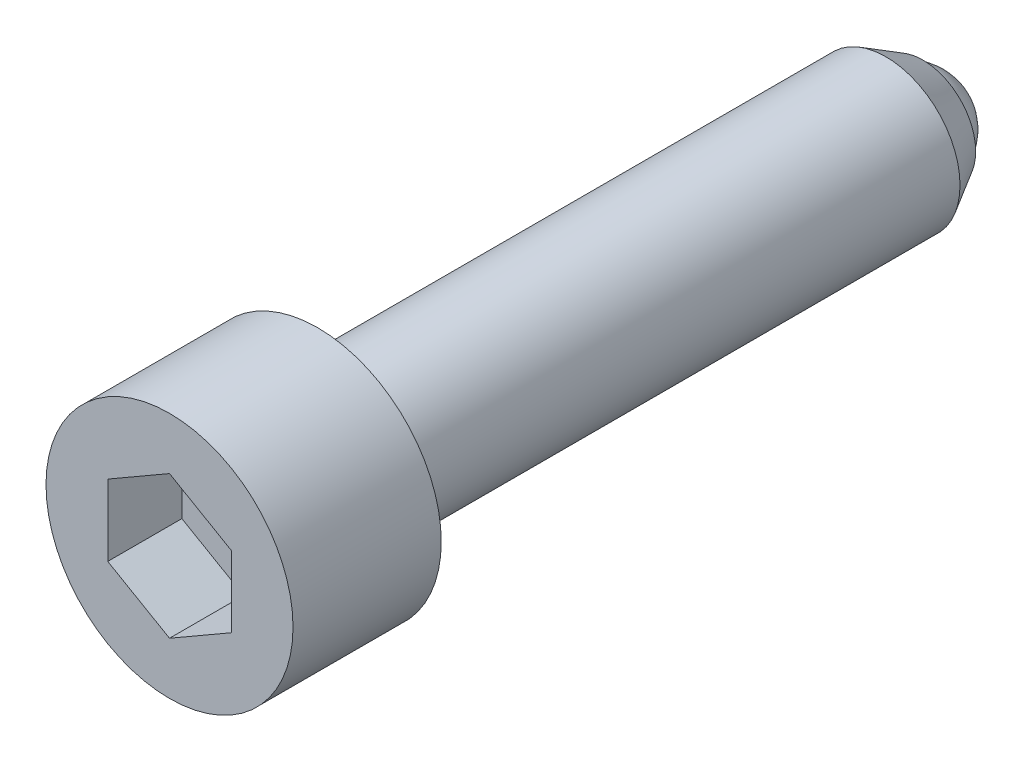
ISO-10303-21;
HEADER;
FILE_DESCRIPTION(('STEP AP214'),'2;1');
FILE_NAME('part.step','',(''),(''),'','','');
FILE_SCHEMA(('AUTOMOTIVE_DESIGN { 1 0 10303 214 1 1 1 1 }'));
ENDSEC;
DATA;
#1=APPLICATION_CONTEXT('core data for automotive mechanical design processes');
#2=APPLICATION_PROTOCOL_DEFINITION('international standard','automotive_design',2000,#1);
#3=PRODUCT_CONTEXT('',#1,'mechanical');
#4=PRODUCT('Part','Part','',(#3));
#5=PRODUCT_RELATED_PRODUCT_CATEGORY('part','',(#4));
#6=PRODUCT_DEFINITION_FORMATION('','',#4);
#7=PRODUCT_DEFINITION_CONTEXT('part definition',#1,'design');
#8=PRODUCT_DEFINITION('design','',#6,#7);
#9=PRODUCT_DEFINITION_SHAPE('','',#8);
#10=(LENGTH_UNIT() NAMED_UNIT(*) SI_UNIT(.MILLI.,.METRE.));
#11=(NAMED_UNIT(*) PLANE_ANGLE_UNIT() SI_UNIT($,.RADIAN.));
#12=(NAMED_UNIT(*) SI_UNIT($,.STERADIAN.) SOLID_ANGLE_UNIT());
#13=UNCERTAINTY_MEASURE_WITH_UNIT(LENGTH_MEASURE(1.E-05),#10,'distance_accuracy_value','');
#14=(GEOMETRIC_REPRESENTATION_CONTEXT(3) GLOBAL_UNCERTAINTY_ASSIGNED_CONTEXT((#13)) GLOBAL_UNIT_ASSIGNED_CONTEXT((#10,
#11,#12)) REPRESENTATION_CONTEXT('',''));
#15=CARTESIAN_POINT('',(0.,0.,0.));
#16=DIRECTION('',(0.,0.,1.));
#17=DIRECTION('',(1.,0.,0.));
#18=AXIS2_PLACEMENT_3D('',#15,#16,#17);
#19=CARTESIAN_POINT('',(0.,0.,2.));
#20=DIRECTION('',(0.,0.,-1.));
#21=DIRECTION('',(1.,0.,0.));
#22=AXIS2_PLACEMENT_3D('',#19,#20,#21);
#23=SPHERICAL_SURFACE('',#22,2.);
#24=CARTESIAN_POINT('',(0.,0.,1.4));
#25=DIRECTION('',(0.,0.,-1.));
#26=DIRECTION('',(1.,0.,0.));
#27=AXIS2_PLACEMENT_3D('',#24,#25,#26);
#28=CIRCLE('',#27,1.90787840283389);
#29=CARTESIAN_POINT('',(1.90787840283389,0.,1.4));
#30=VERTEX_POINT('',#29);
#31=EDGE_CURVE('E9',#30,#30,#28,.T.);
#32=ORIENTED_EDGE('',*,*,#31,.T.);
#33=EDGE_LOOP('',(#32));
#34=FACE_BOUND('',#33,.T.);
#35=ADVANCED_FACE('F15',(#34),#23,.T.);
#36=CARTESIAN_POINT('',(2.13397459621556,0.,1.4));
#37=DIRECTION('',(0.,0.,1.));
#38=DIRECTION('',(-1.,0.,0.));
#39=AXIS2_PLACEMENT_3D('',#36,#37,#38);
#40=PLANE('',#39);
#41=ORIENTED_EDGE('',*,*,#31,.F.);
#42=EDGE_LOOP('',(#41));
#43=FACE_BOUND('',#42,.T.);
#44=CARTESIAN_POINT('',(0.,0.,1.4));
#45=DIRECTION('',(0.,0.,-1.));
#46=DIRECTION('',(1.,0.,0.));
#47=AXIS2_PLACEMENT_3D('',#44,#45,#46);
#48=CIRCLE('',#47,2.13397459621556);
#49=CARTESIAN_POINT('',(2.13397459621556,0.,1.4));
#50=VERTEX_POINT('',#49);
#51=EDGE_CURVE('E22',#50,#50,#48,.T.);
#52=ORIENTED_EDGE('',*,*,#51,.T.);
#53=EDGE_LOOP('',(#52));
#54=FACE_BOUND('',#53,.T.);
#55=ADVANCED_FACE('F136',(#43,#54),#40,.F.);
#56=CARTESIAN_POINT('',(0.,0.,2.9));
#57=DIRECTION('',(0.,0.,1.));
#58=DIRECTION('',(-1.,0.,0.));
#59=AXIS2_PLACEMENT_3D('',#56,#57,#58);
#60=CONICAL_SURFACE('',#59,3.,0.523598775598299);
#61=ORIENTED_EDGE('',*,*,#51,.F.);
#62=EDGE_LOOP('',(#61));
#63=FACE_BOUND('',#62,.T.);
#64=CARTESIAN_POINT('',(0.,0.,2.9));
#65=DIRECTION('',(0.,0.,-1.));
#66=DIRECTION('',(1.,0.,0.));
#67=AXIS2_PLACEMENT_3D('',#64,#65,#66);
#68=CIRCLE('',#67,3.);
#69=CARTESIAN_POINT('',(3.,0.,2.9));
#70=VERTEX_POINT('',#69);
#71=EDGE_CURVE('E131',#70,#70,#68,.T.);
#72=ORIENTED_EDGE('',*,*,#71,.T.);
#73=EDGE_LOOP('',(#72));
#74=FACE_BOUND('',#73,.T.);
#75=ADVANCED_FACE('F138',(#63,#74),#60,.T.);
#76=CARTESIAN_POINT('',(0.,0.,5.9));
#77=DIRECTION('',(0.,0.,-1.));
#78=DIRECTION('',(1.,0.,0.));
#79=AXIS2_PLACEMENT_3D('',#76,#77,#78);
#80=CYLINDRICAL_SURFACE('',#79,3.);
#81=ORIENTED_EDGE('',*,*,#71,.F.);
#82=EDGE_LOOP('',(#81));
#83=FACE_BOUND('',#82,.T.);
#84=CARTESIAN_POINT('',(0.,0.,25.9));
#85=DIRECTION('',(0.,0.,-1.));
#86=DIRECTION('',(1.,0.,0.));
#87=AXIS2_PLACEMENT_3D('',#84,#85,#86);
#88=CIRCLE('',#87,3.);
#89=CARTESIAN_POINT('',(3.,0.,25.9));
#90=VERTEX_POINT('',#89);
#91=EDGE_CURVE('E128',#90,#90,#88,.T.);
#92=ORIENTED_EDGE('',*,*,#91,.T.);
#93=EDGE_LOOP('',(#92));
#94=FACE_BOUND('',#93,.T.);
#95=ADVANCED_FACE('F141',(#83,#94),#80,.T.);
#96=CARTESIAN_POINT('',(3.,0.,25.9));
#97=DIRECTION('',(0.,0.,-1.));
#98=DIRECTION('',(1.,0.,0.));
#99=AXIS2_PLACEMENT_3D('',#96,#97,#98);
#100=PLANE('',#99);
#101=CARTESIAN_POINT('',(0.,0.,25.9));
#102=DIRECTION('',(0.,0.,-1.));
#103=DIRECTION('',(1.,0.,0.));
#104=AXIS2_PLACEMENT_3D('',#101,#102,#103);
#105=CIRCLE('',#104,5.);
#106=CARTESIAN_POINT('',(5.,0.,25.9));
#107=VERTEX_POINT('',#106);
#108=EDGE_CURVE('E125',#107,#107,#105,.T.);
#109=ORIENTED_EDGE('',*,*,#108,.T.);
#110=EDGE_LOOP('',(#109));
#111=FACE_BOUND('',#110,.T.);
#112=ORIENTED_EDGE('',*,*,#91,.F.);
#113=EDGE_LOOP('',(#112));
#114=FACE_BOUND('',#113,.T.);
#115=ADVANCED_FACE('F147',(#111,#114),#100,.T.);
#116=CARTESIAN_POINT('',(0.,0.,5.9));
#117=DIRECTION('',(0.,0.,-1.));
#118=DIRECTION('',(1.,0.,0.));
#119=AXIS2_PLACEMENT_3D('',#116,#117,#118);
#120=CYLINDRICAL_SURFACE('',#119,5.);
#121=CARTESIAN_POINT('',(0.,0.,31.9));
#122=DIRECTION('',(0.,0.,-1.));
#123=DIRECTION('',(1.,0.,0.));
#124=AXIS2_PLACEMENT_3D('',#121,#122,#123);
#125=CIRCLE('',#124,5.);
#126=CARTESIAN_POINT('',(5.,0.,31.9));
#127=VERTEX_POINT('',#126);
#128=EDGE_CURVE('E122',#127,#127,#125,.T.);
#129=ORIENTED_EDGE('',*,*,#128,.T.);
#130=EDGE_LOOP('',(#129));
#131=FACE_BOUND('',#130,.T.);
#132=ORIENTED_EDGE('',*,*,#108,.F.);
#133=EDGE_LOOP('',(#132));
#134=FACE_BOUND('',#133,.T.);
#135=ADVANCED_FACE('F152',(#131,#134),#120,.T.);
#136=CARTESIAN_POINT('',(5.,0.,31.9));
#137=DIRECTION('',(0.,0.,1.));
#138=DIRECTION('',(-1.,0.,0.));
#139=AXIS2_PLACEMENT_3D('',#136,#137,#138);
#140=PLANE('',#139);
#141=DIRECTION('',(-0.86602540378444,0.5,0.));
#142=VECTOR('',#141,1.);
#143=CARTESIAN_POINT('',(2.5,1.44337567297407,31.9));
#144=LINE('',#143,#142);
#145=CARTESIAN_POINT('',(2.5,1.44337567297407,31.9));
#146=VERTEX_POINT('',#145);
#147=CARTESIAN_POINT('',(0.,2.88675134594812,31.9));
#148=VERTEX_POINT('',#147);
#149=EDGE_CURVE('E29',#146,#148,#144,.T.);
#150=ORIENTED_EDGE('',*,*,#149,.F.);
#151=DIRECTION('',(0.,1.,0.));
#152=VECTOR('',#151,1.);
#153=CARTESIAN_POINT('',(2.5,-1.44337567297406,31.9));
#154=LINE('',#153,#152);
#155=CARTESIAN_POINT('',(2.5,-1.44337567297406,31.9));
#156=VERTEX_POINT('',#155);
#157=EDGE_CURVE('E98',#156,#146,#154,.T.);
#158=ORIENTED_EDGE('',*,*,#157,.F.);
#159=DIRECTION('',(-0.866025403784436,-0.5,0.));
#160=VECTOR('',#159,1.);
#161=CARTESIAN_POINT('',(2.5,-1.44337567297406,31.9));
#162=LINE('',#161,#160);
#163=CARTESIAN_POINT('',(0.,-2.88675134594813,31.9));
#164=VERTEX_POINT('',#163);
#165=EDGE_CURVE('E93',#156,#164,#162,.T.);
#166=ORIENTED_EDGE('',*,*,#165,.T.);
#167=DIRECTION('',(0.866025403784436,-0.5,0.));
#168=VECTOR('',#167,1.);
#169=CARTESIAN_POINT('',(-2.5,-1.44337567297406,31.9));
#170=LINE('',#169,#168);
#171=CARTESIAN_POINT('',(-2.5,-1.44337567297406,31.9));
#172=VERTEX_POINT('',#171);
#173=EDGE_CURVE('E91',#172,#164,#170,.T.);
#174=ORIENTED_EDGE('',*,*,#173,.F.);
#175=DIRECTION('',(0.,1.,0.));
#176=VECTOR('',#175,1.);
#177=CARTESIAN_POINT('',(-2.5,-1.44337567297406,31.9));
#178=LINE('',#177,#176);
#179=CARTESIAN_POINT('',(-2.5,1.44337567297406,31.9));
#180=VERTEX_POINT('',#179);
#181=EDGE_CURVE('E72',#172,#180,#178,.T.);
#182=ORIENTED_EDGE('',*,*,#181,.T.);
#183=DIRECTION('',(0.866025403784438,0.5,0.));
#184=VECTOR('',#183,1.);
#185=CARTESIAN_POINT('',(-2.5,1.44337567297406,31.9));
#186=LINE('',#185,#184);
#187=EDGE_CURVE('E83',#180,#148,#186,.T.);
#188=ORIENTED_EDGE('',*,*,#187,.T.);
#189=EDGE_LOOP('',(#150,#158,#166,#174,#182,#188));
#190=FACE_BOUND('',#189,.T.);
#191=ORIENTED_EDGE('',*,*,#128,.F.);
#192=EDGE_LOOP('',(#191));
#193=FACE_BOUND('',#192,.T.);
#194=ADVANCED_FACE('F87',(#190,#193),#140,.T.);
#195=CARTESIAN_POINT('',(2.5,1.44337567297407,28.9));
#196=DIRECTION('',(0.5,0.86602540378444,0.));
#197=DIRECTION('',(0.86602540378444,-0.5,0.));
#198=AXIS2_PLACEMENT_3D('',#195,#196,#197);
#199=PLANE('',#198);
#200=DIRECTION('',(0.,0.,1.));
#201=VECTOR('',#200,1.);
#202=CARTESIAN_POINT('',(2.5,1.44337567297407,28.9));
#203=LINE('',#202,#201);
#204=CARTESIAN_POINT('',(2.5,1.44337567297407,28.9));
#205=VERTEX_POINT('',#204);
#206=EDGE_CURVE('E36',#205,#146,#203,.T.);
#207=ORIENTED_EDGE('',*,*,#206,.T.);
#208=ORIENTED_EDGE('',*,*,#149,.T.);
#209=DIRECTION('',(0.,0.,1.));
#210=VECTOR('',#209,1.);
#211=CARTESIAN_POINT('',(0.,2.88675134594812,28.9));
#212=LINE('',#211,#210);
#213=CARTESIAN_POINT('',(0.,2.88675134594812,28.9));
#214=VERTEX_POINT('',#213);
#215=EDGE_CURVE('E80',#214,#148,#212,.T.);
#216=ORIENTED_EDGE('',*,*,#215,.F.);
#217=DIRECTION('',(-0.86602540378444,0.5,0.));
#218=VECTOR('',#217,1.);
#219=CARTESIAN_POINT('',(2.5,1.44337567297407,28.9));
#220=LINE('',#219,#218);
#221=EDGE_CURVE('E100',#205,#214,#220,.T.);
#222=ORIENTED_EDGE('',*,*,#221,.F.);
#223=EDGE_LOOP('',(#207,#208,#216,#222));
#224=FACE_BOUND('',#223,.T.);
#225=ADVANCED_FACE('F206',(#224),#199,.F.);
#226=CARTESIAN_POINT('',(2.5,-1.44337567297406,28.9));
#227=DIRECTION('',(1.,0.,0.));
#228=DIRECTION('',(0.,0.,1.));
#229=AXIS2_PLACEMENT_3D('',#226,#227,#228);
#230=PLANE('',#229);
#231=DIRECTION('',(0.,0.,1.));
#232=VECTOR('',#231,1.);
#233=CARTESIAN_POINT('',(2.5,-1.44337567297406,28.9));
#234=LINE('',#233,#232);
#235=CARTESIAN_POINT('',(2.5,-1.44337567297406,28.9));
#236=VERTEX_POINT('',#235);
#237=EDGE_CURVE('E119',#236,#156,#234,.T.);
#238=ORIENTED_EDGE('',*,*,#237,.T.);
#239=ORIENTED_EDGE('',*,*,#157,.T.);
#240=ORIENTED_EDGE('',*,*,#206,.F.);
#241=DIRECTION('',(0.,1.,0.));
#242=VECTOR('',#241,1.);
#243=CARTESIAN_POINT('',(2.5,-1.44337567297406,28.9));
#244=LINE('',#243,#242);
#245=EDGE_CURVE('E112',#236,#205,#244,.T.);
#246=ORIENTED_EDGE('',*,*,#245,.F.);
#247=EDGE_LOOP('',(#238,#239,#240,#246));
#248=FACE_BOUND('',#247,.T.);
#249=ADVANCED_FACE('F215',(#248),#230,.F.);
#250=CARTESIAN_POINT('',(2.5,-1.44337567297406,28.9));
#251=DIRECTION('',(-0.5,0.866025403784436,0.));
#252=DIRECTION('',(0.866025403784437,0.5,0.));
#253=AXIS2_PLACEMENT_3D('',#250,#251,#252);
#254=PLANE('',#253);
#255=DIRECTION('',(0.,0.,1.));
#256=VECTOR('',#255,1.);
#257=CARTESIAN_POINT('',(0.,-2.88675134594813,28.9));
#258=LINE('',#257,#256);
#259=CARTESIAN_POINT('',(0.,-2.88675134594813,28.9));
#260=VERTEX_POINT('',#259);
#261=EDGE_CURVE('E117',#260,#164,#258,.T.);
#262=ORIENTED_EDGE('',*,*,#261,.T.);
#263=ORIENTED_EDGE('',*,*,#165,.F.);
#264=ORIENTED_EDGE('',*,*,#237,.F.);
#265=DIRECTION('',(-0.866025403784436,-0.5,0.));
#266=VECTOR('',#265,1.);
#267=CARTESIAN_POINT('',(2.5,-1.44337567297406,28.9));
#268=LINE('',#267,#266);
#269=EDGE_CURVE('E109',#236,#260,#268,.T.);
#270=ORIENTED_EDGE('',*,*,#269,.T.);
#271=EDGE_LOOP('',(#262,#263,#264,#270));
#272=FACE_BOUND('',#271,.T.);
#273=ADVANCED_FACE('F224',(#272),#254,.T.);
#274=CARTESIAN_POINT('',(-2.5,-1.44337567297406,28.9));
#275=DIRECTION('',(-0.5,-0.866025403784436,0.));
#276=DIRECTION('',(-0.866025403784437,0.5,0.));
#277=AXIS2_PLACEMENT_3D('',#274,#275,#276);
#278=PLANE('',#277);
#279=DIRECTION('',(0.,0.,1.));
#280=VECTOR('',#279,1.);
#281=CARTESIAN_POINT('',(-2.5,-1.44337567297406,28.9));
#282=LINE('',#281,#280);
#283=CARTESIAN_POINT('',(-2.5,-1.44337567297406,28.9));
#284=VERTEX_POINT('',#283);
#285=EDGE_CURVE('E79',#284,#172,#282,.T.);
#286=ORIENTED_EDGE('',*,*,#285,.T.);
#287=ORIENTED_EDGE('',*,*,#173,.T.);
#288=ORIENTED_EDGE('',*,*,#261,.F.);
#289=DIRECTION('',(0.866025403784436,-0.5,0.));
#290=VECTOR('',#289,1.);
#291=CARTESIAN_POINT('',(-2.5,-1.44337567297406,28.9));
#292=LINE('',#291,#290);
#293=EDGE_CURVE('E106',#284,#260,#292,.T.);
#294=ORIENTED_EDGE('',*,*,#293,.F.);
#295=EDGE_LOOP('',(#286,#287,#288,#294));
#296=FACE_BOUND('',#295,.T.);
#297=ADVANCED_FACE('F233',(#296),#278,.F.);
#298=CARTESIAN_POINT('',(-2.5,-1.44337567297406,28.9));
#299=DIRECTION('',(1.,0.,0.));
#300=DIRECTION('',(0.,-1.,0.));
#301=AXIS2_PLACEMENT_3D('',#298,#299,#300);
#302=PLANE('',#301);
#303=DIRECTION('',(0.,0.,1.));
#304=VECTOR('',#303,1.);
#305=CARTESIAN_POINT('',(-2.5,1.44337567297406,28.9));
#306=LINE('',#305,#304);
#307=CARTESIAN_POINT('',(-2.5,1.44337567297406,28.9));
#308=VERTEX_POINT('',#307);
#309=EDGE_CURVE('E68',#308,#180,#306,.T.);
#310=ORIENTED_EDGE('',*,*,#309,.T.);
#311=ORIENTED_EDGE('',*,*,#181,.F.);
#312=ORIENTED_EDGE('',*,*,#285,.F.);
#313=DIRECTION('',(0.,1.,0.));
#314=VECTOR('',#313,1.);
#315=CARTESIAN_POINT('',(-2.5,-1.44337567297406,28.9));
#316=LINE('',#315,#314);
#317=EDGE_CURVE('E75',#284,#308,#316,.T.);
#318=ORIENTED_EDGE('',*,*,#317,.T.);
#319=EDGE_LOOP('',(#310,#311,#312,#318));
#320=FACE_BOUND('',#319,.T.);
#321=ADVANCED_FACE('F70',(#320),#302,.T.);
#322=CARTESIAN_POINT('',(-2.5,1.44337567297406,28.9));
#323=DIRECTION('',(0.5,-0.866025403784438,0.));
#324=DIRECTION('',(-0.866025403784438,-0.5,0.));
#325=AXIS2_PLACEMENT_3D('',#322,#323,#324);
#326=PLANE('',#325);
#327=DIRECTION('',(0.866025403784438,0.5,0.));
#328=VECTOR('',#327,1.);
#329=CARTESIAN_POINT('',(-2.5,1.44337567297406,28.9));
#330=LINE('',#329,#328);
#331=EDGE_CURVE('E103',#308,#214,#330,.T.);
#332=ORIENTED_EDGE('',*,*,#331,.T.);
#333=ORIENTED_EDGE('',*,*,#215,.T.);
#334=ORIENTED_EDGE('',*,*,#187,.F.);
#335=ORIENTED_EDGE('',*,*,#309,.F.);
#336=EDGE_LOOP('',(#332,#333,#334,#335));
#337=FACE_BOUND('',#336,.T.);
#338=ADVANCED_FACE('F84',(#337),#326,.T.);
#339=CARTESIAN_POINT('',(2.5,1.44337567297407,28.9));
#340=DIRECTION('',(0.,0.,-1.));
#341=DIRECTION('',(1.,0.,0.));
#342=AXIS2_PLACEMENT_3D('',#339,#340,#341);
#343=PLANE('',#342);
#344=ORIENTED_EDGE('',*,*,#221,.T.);
#345=ORIENTED_EDGE('',*,*,#331,.F.);
#346=ORIENTED_EDGE('',*,*,#317,.F.);
#347=ORIENTED_EDGE('',*,*,#293,.T.);
#348=ORIENTED_EDGE('',*,*,#269,.F.);
#349=ORIENTED_EDGE('',*,*,#245,.T.);
#350=EDGE_LOOP('',(#344,#345,#346,#347,#348,#349));
#351=FACE_BOUND('',#350,.T.);
#352=ADVANCED_FACE('F253',(#351),#343,.F.);
#353=CLOSED_SHELL('',(#35,#55,#75,#95,#115,#135,#194,#225,#249,#273,#297,#321,#338,#352));
#354=MANIFOLD_SOLID_BREP('B1',#353);
#355=ADVANCED_BREP_SHAPE_REPRESENTATION('',(#18,#354),#14);
#356=SHAPE_DEFINITION_REPRESENTATION(#9,#355);
ENDSEC;
END-ISO-10303-21;
